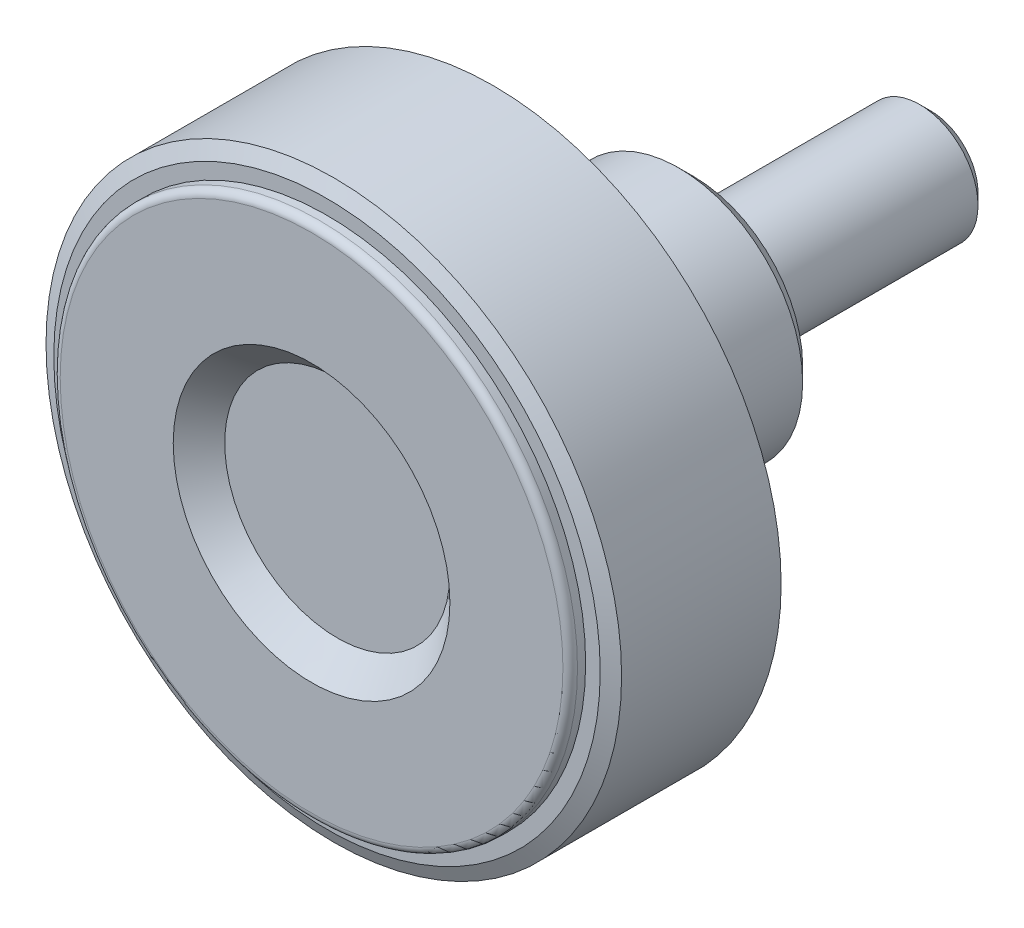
ISO-10303-21;
HEADER;
FILE_DESCRIPTION(('STEP AP214'),'2;1');
FILE_NAME('part.step','',(''),(''),'','','');
FILE_SCHEMA(('AUTOMOTIVE_DESIGN { 1 0 10303 214 1 1 1 1 }'));
ENDSEC;
DATA;
#1=APPLICATION_CONTEXT('core data for automotive mechanical design processes');
#2=APPLICATION_PROTOCOL_DEFINITION('international standard','automotive_design',2000,#1);
#3=PRODUCT_CONTEXT('',#1,'mechanical');
#4=PRODUCT('Part','Part','',(#3));
#5=PRODUCT_RELATED_PRODUCT_CATEGORY('part','',(#4));
#6=PRODUCT_DEFINITION_FORMATION('','',#4);
#7=PRODUCT_DEFINITION_CONTEXT('part definition',#1,'design');
#8=PRODUCT_DEFINITION('design','',#6,#7);
#9=PRODUCT_DEFINITION_SHAPE('','',#8);
#10=(LENGTH_UNIT() NAMED_UNIT(*) SI_UNIT(.MILLI.,.METRE.));
#11=(NAMED_UNIT(*) PLANE_ANGLE_UNIT() SI_UNIT($,.RADIAN.));
#12=(NAMED_UNIT(*) SI_UNIT($,.STERADIAN.) SOLID_ANGLE_UNIT());
#13=UNCERTAINTY_MEASURE_WITH_UNIT(LENGTH_MEASURE(1.E-05),#10,'distance_accuracy_value','');
#14=(GEOMETRIC_REPRESENTATION_CONTEXT(3) GLOBAL_UNCERTAINTY_ASSIGNED_CONTEXT((#13)) GLOBAL_UNIT_ASSIGNED_CONTEXT((#10,
#11,#12)) REPRESENTATION_CONTEXT('',''));
#15=CARTESIAN_POINT('',(0.,0.,0.));
#16=DIRECTION('',(0.,0.,1.));
#17=DIRECTION('',(1.,0.,0.));
#18=AXIS2_PLACEMENT_3D('',#15,#16,#17);
#19=CARTESIAN_POINT('',(0.,1.6165,-16.));
#20=DIRECTION('',(0.,0.,-1.));
#21=DIRECTION('',(-1.,0.,0.));
#22=AXIS2_PLACEMENT_3D('',#19,#20,#21);
#23=PLANE('',#22);
#24=CARTESIAN_POINT('',(0.,0.,-16.0000000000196));
#25=DIRECTION('',(0.,0.,1.));
#26=DIRECTION('',(1.,0.,0.));
#27=AXIS2_PLACEMENT_3D('',#24,#25,#26);
#28=CIRCLE('',#27,3.23299999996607);
#29=CARTESIAN_POINT('',(3.23299999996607,0.,-16.0000000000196));
#30=VERTEX_POINT('',#29);
#31=EDGE_CURVE('E179',#30,#30,#28,.T.);
#32=ORIENTED_EDGE('',*,*,#31,.F.);
#33=EDGE_LOOP('',(#32));
#34=FACE_BOUND('',#33,.T.);
#35=ADVANCED_FACE('F14',(#34),#23,.T.);
#36=CARTESIAN_POINT('',(0.,0.,-15.2329999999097));
#37=DIRECTION('',(0.,0.,1.));
#38=DIRECTION('',(1.,0.,0.));
#39=AXIS2_PLACEMENT_3D('',#36,#37,#38);
#40=CONICAL_SURFACE('',#39,4.00000000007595,0.785398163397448);
#41=ORIENTED_EDGE('',*,*,#31,.T.);
#42=EDGE_LOOP('',(#41));
#43=FACE_BOUND('',#42,.T.);
#44=CARTESIAN_POINT('',(0.,0.,-15.233));
#45=DIRECTION('',(0.,0.,1.));
#46=DIRECTION('',(1.,0.,0.));
#47=AXIS2_PLACEMENT_3D('',#44,#45,#46);
#48=CIRCLE('',#47,4.);
#49=CARTESIAN_POINT('',(4.,0.,-15.233));
#50=VERTEX_POINT('',#49);
#51=EDGE_CURVE('E176',#50,#50,#48,.T.);
#52=ORIENTED_EDGE('',*,*,#51,.F.);
#53=EDGE_LOOP('',(#52));
#54=FACE_BOUND('',#53,.T.);
#55=ADVANCED_FACE('F536',(#43,#54),#40,.T.);
#56=CARTESIAN_POINT('',(0.,0.,-7.1165));
#57=DIRECTION('',(0.,0.,1.));
#58=DIRECTION('',(1.,0.,0.));
#59=AXIS2_PLACEMENT_3D('',#56,#57,#58);
#60=CYLINDRICAL_SURFACE('',#59,4.);
#61=ORIENTED_EDGE('',*,*,#51,.T.);
#62=EDGE_LOOP('',(#61));
#63=FACE_BOUND('',#62,.T.);
#64=CARTESIAN_POINT('',(0.,0.,0.));
#65=DIRECTION('',(0.,0.,1.));
#66=DIRECTION('',(1.,0.,0.));
#67=AXIS2_PLACEMENT_3D('',#64,#65,#66);
#68=CIRCLE('',#67,4.);
#69=CARTESIAN_POINT('',(4.,0.,0.));
#70=VERTEX_POINT('',#69);
#71=EDGE_CURVE('E178',#70,#70,#68,.T.);
#72=ORIENTED_EDGE('',*,*,#71,.F.);
#73=EDGE_LOOP('',(#72));
#74=FACE_BOUND('',#73,.T.);
#75=ADVANCED_FACE('F526',(#63,#74),#60,.T.);
#76=CARTESIAN_POINT('',(0.,2.66666666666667,0.));
#77=DIRECTION('',(0.,0.,-1.));
#78=DIRECTION('',(-1.,0.,0.));
#79=AXIS2_PLACEMENT_3D('',#76,#77,#78);
#80=PLANE('',#79);
#81=CARTESIAN_POINT('',(0.,0.,0.));
#82=DIRECTION('',(0.,0.,1.));
#83=DIRECTION('',(1.,0.,0.));
#84=AXIS2_PLACEMENT_3D('',#81,#82,#83);
#85=CIRCLE('',#84,5.33333333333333);
#86=CARTESIAN_POINT('',(5.33333333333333,0.,0.));
#87=VERTEX_POINT('',#86);
#88=EDGE_CURVE('E211',#87,#87,#85,.T.);
#89=ORIENTED_EDGE('',*,*,#88,.F.);
#90=EDGE_LOOP('',(#89));
#91=FACE_BOUND('',#90,.T.);
#92=ORIENTED_EDGE('',*,*,#71,.T.);
#93=EDGE_LOOP('',(#92));
#94=FACE_BOUND('',#93,.T.);
#95=ADVANCED_FACE('F516',(#91,#94),#80,.T.);
#96=CARTESIAN_POINT('',(0.,0.,0.15));
#97=DIRECTION('',(0.,0.,1.));
#98=DIRECTION('',(1.,0.,0.));
#99=AXIS2_PLACEMENT_3D('',#96,#97,#98);
#100=CYLINDRICAL_SURFACE('',#99,5.33333333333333);
#101=ORIENTED_EDGE('',*,*,#88,.T.);
#102=EDGE_LOOP('',(#101));
#103=FACE_BOUND('',#102,.T.);
#104=CARTESIAN_POINT('',(0.,0.,0.3));
#105=DIRECTION('',(0.,0.,1.));
#106=DIRECTION('',(1.,0.,0.));
#107=AXIS2_PLACEMENT_3D('',#104,#105,#106);
#108=CIRCLE('',#107,5.33333333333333);
#109=CARTESIAN_POINT('',(5.33333333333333,0.,0.3));
#110=VERTEX_POINT('',#109);
#111=EDGE_CURVE('E208',#110,#110,#108,.T.);
#112=ORIENTED_EDGE('',*,*,#111,.F.);
#113=EDGE_LOOP('',(#112));
#114=FACE_BOUND('',#113,.T.);
#115=ADVANCED_FACE('F506',(#103,#114),#100,.T.);
#116=CARTESIAN_POINT('',(0.,6.41666666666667,0.3));
#117=DIRECTION('',(0.,0.,-1.));
#118=DIRECTION('',(-1.,0.,0.));
#119=AXIS2_PLACEMENT_3D('',#116,#117,#118);
#120=PLANE('',#119);
#121=CARTESIAN_POINT('',(0.,0.,0.3));
#122=DIRECTION('',(0.,0.,1.));
#123=DIRECTION('',(1.,0.,0.));
#124=AXIS2_PLACEMENT_3D('',#121,#122,#123);
#125=CIRCLE('',#124,7.5);
#126=CARTESIAN_POINT('',(7.5,0.,0.3));
#127=VERTEX_POINT('',#126);
#128=EDGE_CURVE('E175',#127,#127,#125,.T.);
#129=ORIENTED_EDGE('',*,*,#128,.F.);
#130=EDGE_LOOP('',(#129));
#131=FACE_BOUND('',#130,.T.);
#132=ORIENTED_EDGE('',*,*,#111,.T.);
#133=EDGE_LOOP('',(#132));
#134=FACE_BOUND('',#133,.T.);
#135=ADVANCED_FACE('F496',(#131,#134),#120,.T.);
#136=CARTESIAN_POINT('',(0.,0.,1.3));
#137=DIRECTION('',(0.,0.,1.));
#138=DIRECTION('',(1.,0.,0.));
#139=AXIS2_PLACEMENT_3D('',#136,#137,#138);
#140=CONICAL_SURFACE('',#139,8.5,0.785398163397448);
#141=ORIENTED_EDGE('',*,*,#128,.T.);
#142=EDGE_LOOP('',(#141));
#143=FACE_BOUND('',#142,.T.);
#144=CARTESIAN_POINT('',(0.,0.,1.3));
#145=DIRECTION('',(0.,0.,1.));
#146=DIRECTION('',(1.,0.,0.));
#147=AXIS2_PLACEMENT_3D('',#144,#145,#146);
#148=CIRCLE('',#147,8.5);
#149=CARTESIAN_POINT('',(8.5,0.,1.3));
#150=VERTEX_POINT('',#149);
#151=EDGE_CURVE('E172',#150,#150,#148,.T.);
#152=ORIENTED_EDGE('',*,*,#151,.F.);
#153=EDGE_LOOP('',(#152));
#154=FACE_BOUND('',#153,.T.);
#155=ADVANCED_FACE('F487',(#143,#154),#140,.T.);
#156=CARTESIAN_POINT('',(0.,0.,11.1916666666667));
#157=DIRECTION('',(0.,0.,1.));
#158=DIRECTION('',(1.,0.,0.));
#159=AXIS2_PLACEMENT_3D('',#156,#157,#158);
#160=CYLINDRICAL_SURFACE('',#159,8.5);
#161=ORIENTED_EDGE('',*,*,#151,.T.);
#162=EDGE_LOOP('',(#161));
#163=FACE_BOUND('',#162,.T.);
#164=CARTESIAN_POINT('',(0.,0.,21.0833333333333));
#165=DIRECTION('',(0.,0.,-1.));
#166=DIRECTION('',(-1.,0.,0.));
#167=AXIS2_PLACEMENT_3D('',#164,#165,#166);
#168=CIRCLE('',#167,8.5);
#169=CARTESIAN_POINT('',(-8.5,0.,21.0833333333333));
#170=VERTEX_POINT('',#169);
#171=EDGE_CURVE('E75',#170,#170,#168,.T.);
#172=ORIENTED_EDGE('',*,*,#171,.T.);
#173=EDGE_LOOP('',(#172));
#174=FACE_BOUND('',#173,.T.);
#175=ADVANCED_FACE('F482',(#163,#174),#160,.T.);
#176=CARTESIAN_POINT('',(0.,0.,21.0833333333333));
#177=DIRECTION('',(0.,0.,-1.));
#178=DIRECTION('',(-1.,0.,0.));
#179=AXIS2_PLACEMENT_3D('',#176,#177,#178);
#180=TOROIDAL_SURFACE('',#179,9.5,1.);
#181=CARTESIAN_POINT('',(0.,0.,22.0833333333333));
#182=DIRECTION('',(0.,0.,-1.));
#183=DIRECTION('',(1.,0.,0.));
#184=AXIS2_PLACEMENT_3D('',#181,#182,#183);
#185=CIRCLE('',#184,9.5);
#186=CARTESIAN_POINT('',(-9.5,0.,22.0833333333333));
#187=VERTEX_POINT('',#186);
#188=CARTESIAN_POINT('',(9.5,0.,22.0833333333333));
#189=VERTEX_POINT('',#188);
#190=EDGE_CURVE('E68',#187,#189,#185,.F.);
#191=ORIENTED_EDGE('',*,*,#190,.F.);
#192=CARTESIAN_POINT('',(0.,0.,22.0833333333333));
#193=DIRECTION('',(0.,0.,-1.));
#194=DIRECTION('',(-1.,0.,0.));
#195=AXIS2_PLACEMENT_3D('',#192,#193,#194);
#196=CIRCLE('',#195,9.5);
#197=CARTESIAN_POINT('',(0.,9.5,22.0833333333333));
#198=VERTEX_POINT('',#197);
#199=EDGE_CURVE('E71',#198,#187,#196,.F.);
#200=ORIENTED_EDGE('',*,*,#199,.F.);
#201=CARTESIAN_POINT('',(0.,0.,22.0833333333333));
#202=DIRECTION('',(0.,0.,-1.));
#203=DIRECTION('',(0.,1.,0.));
#204=AXIS2_PLACEMENT_3D('',#201,#202,#203);
#205=CIRCLE('',#204,9.5);
#206=EDGE_CURVE('E63',#189,#198,#205,.F.);
#207=ORIENTED_EDGE('',*,*,#206,.F.);
#208=EDGE_LOOP('',(#191,#200,#207));
#209=FACE_BOUND('',#208,.T.);
#210=ORIENTED_EDGE('',*,*,#171,.F.);
#211=EDGE_LOOP('',(#210));
#212=FACE_BOUND('',#211,.T.);
#213=ADVANCED_FACE('F66',(#209,#212),#180,.F.);
#214=CARTESIAN_POINT('',(0.,11.8461538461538,22.0833333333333));
#215=DIRECTION('',(0.,0.,-1.));
#216=DIRECTION('',(-1.,0.,0.));
#217=AXIS2_PLACEMENT_3D('',#214,#215,#216);
#218=PLANE('',#217);
#219=CARTESIAN_POINT('',(0.,0.,22.0833333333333));
#220=DIRECTION('',(0.,0.,1.));
#221=DIRECTION('',(-1.,0.,0.));
#222=AXIS2_PLACEMENT_3D('',#219,#220,#221);
#223=CIRCLE('',#222,14.1923076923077);
#224=CARTESIAN_POINT('',(14.1923076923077,0.,22.0833333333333));
#225=VERTEX_POINT('',#224);
#226=CARTESIAN_POINT('',(-14.1923076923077,0.,22.0833333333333));
#227=VERTEX_POINT('',#226);
#228=EDGE_CURVE('E81',#225,#227,#223,.F.);
#229=ORIENTED_EDGE('',*,*,#228,.T.);
#230=CARTESIAN_POINT('',(0.,0.,22.0833333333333));
#231=DIRECTION('',(0.,0.,1.));
#232=DIRECTION('',(0.,1.,0.));
#233=AXIS2_PLACEMENT_3D('',#230,#231,#232);
#234=CIRCLE('',#233,14.1923076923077);
#235=CARTESIAN_POINT('',(0.,14.1923076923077,22.0833333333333));
#236=VERTEX_POINT('',#235);
#237=EDGE_CURVE('E130',#227,#236,#234,.F.);
#238=ORIENTED_EDGE('',*,*,#237,.T.);
#239=CARTESIAN_POINT('',(0.,0.,22.0833333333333));
#240=DIRECTION('',(0.,0.,1.));
#241=DIRECTION('',(1.,0.,0.));
#242=AXIS2_PLACEMENT_3D('',#239,#240,#241);
#243=CIRCLE('',#242,14.1923076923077);
#244=EDGE_CURVE('E143',#236,#225,#243,.F.);
#245=ORIENTED_EDGE('',*,*,#244,.T.);
#246=EDGE_LOOP('',(#229,#238,#245));
#247=FACE_BOUND('',#246,.T.);
#248=ORIENTED_EDGE('',*,*,#199,.T.);
#249=ORIENTED_EDGE('',*,*,#190,.T.);
#250=ORIENTED_EDGE('',*,*,#206,.T.);
#251=EDGE_LOOP('',(#248,#249,#250));
#252=FACE_BOUND('',#251,.T.);
#253=ADVANCED_FACE('F79',(#247,#252),#218,.T.);
#254=CARTESIAN_POINT('',(0.,0.,21.0833333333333));
#255=DIRECTION('',(0.,0.,-1.));
#256=DIRECTION('',(-1.,0.,0.));
#257=AXIS2_PLACEMENT_3D('',#254,#255,#256);
#258=TOROIDAL_SURFACE('',#257,14.1923076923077,1.);
#259=ORIENTED_EDGE('',*,*,#237,.F.);
#260=ORIENTED_EDGE('',*,*,#228,.F.);
#261=ORIENTED_EDGE('',*,*,#244,.F.);
#262=EDGE_LOOP('',(#259,#260,#261));
#263=FACE_BOUND('',#262,.T.);
#264=CARTESIAN_POINT('',(0.,0.,21.0833333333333));
#265=DIRECTION('',(0.,0.,1.));
#266=DIRECTION('',(1.,0.,0.));
#267=AXIS2_PLACEMENT_3D('',#264,#265,#266);
#268=CIRCLE('',#267,15.1923076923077);
#269=CARTESIAN_POINT('',(15.1923076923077,0.,21.0833333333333));
#270=VERTEX_POINT('',#269);
#271=EDGE_CURVE('E205',#270,#270,#268,.F.);
#272=ORIENTED_EDGE('',*,*,#271,.T.);
#273=EDGE_LOOP('',(#272));
#274=FACE_BOUND('',#273,.T.);
#275=ADVANCED_FACE('F100',(#263,#274),#258,.F.);
#276=CARTESIAN_POINT('',(0.,0.,16.7916666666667));
#277=DIRECTION('',(0.,0.,1.));
#278=DIRECTION('',(1.,0.,0.));
#279=AXIS2_PLACEMENT_3D('',#276,#277,#278);
#280=CYLINDRICAL_SURFACE('',#279,15.1923076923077);
#281=ORIENTED_EDGE('',*,*,#271,.F.);
#282=EDGE_LOOP('',(#281));
#283=FACE_BOUND('',#282,.T.);
#284=CARTESIAN_POINT('',(0.,0.,12.5));
#285=DIRECTION('',(0.,0.,1.));
#286=DIRECTION('',(1.,0.,0.));
#287=AXIS2_PLACEMENT_3D('',#284,#285,#286);
#288=CIRCLE('',#287,15.1923076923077);
#289=CARTESIAN_POINT('',(15.1923076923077,0.,12.5));
#290=VERTEX_POINT('',#289);
#291=EDGE_CURVE('E201',#290,#290,#288,.T.);
#292=ORIENTED_EDGE('',*,*,#291,.F.);
#293=EDGE_LOOP('',(#292));
#294=FACE_BOUND('',#293,.T.);
#295=ADVANCED_FACE('F329',(#283,#294),#280,.F.);
#296=CARTESIAN_POINT('',(0.,16.2211538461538,12.5));
#297=DIRECTION('',(0.,0.,-1.));
#298=DIRECTION('',(-1.,0.,0.));
#299=AXIS2_PLACEMENT_3D('',#296,#297,#298);
#300=PLANE('',#299);
#301=CARTESIAN_POINT('',(0.,0.,12.5));
#302=DIRECTION('',(0.,0.,1.));
#303=DIRECTION('',(-1.,0.,0.));
#304=AXIS2_PLACEMENT_3D('',#301,#302,#303);
#305=CIRCLE('',#304,17.25);
#306=CARTESIAN_POINT('',(-17.25,0.,12.5));
#307=VERTEX_POINT('',#306);
#308=CARTESIAN_POINT('',(17.25,0.,12.5));
#309=VERTEX_POINT('',#308);
#310=EDGE_CURVE('E264',#307,#309,#305,.T.);
#311=ORIENTED_EDGE('',*,*,#310,.F.);
#312=CARTESIAN_POINT('',(0.,0.,12.5));
#313=DIRECTION('',(0.,0.,1.));
#314=DIRECTION('',(0.,1.,0.));
#315=AXIS2_PLACEMENT_3D('',#312,#313,#314);
#316=CIRCLE('',#315,17.25);
#317=CARTESIAN_POINT('',(0.,17.25,12.5));
#318=VERTEX_POINT('',#317);
#319=EDGE_CURVE('E299',#318,#307,#316,.T.);
#320=ORIENTED_EDGE('',*,*,#319,.F.);
#321=CARTESIAN_POINT('',(0.,0.,12.5));
#322=DIRECTION('',(0.,0.,1.));
#323=DIRECTION('',(1.,0.,0.));
#324=AXIS2_PLACEMENT_3D('',#321,#322,#323);
#325=CIRCLE('',#324,17.25);
#326=EDGE_CURVE('E204',#309,#318,#325,.T.);
#327=ORIENTED_EDGE('',*,*,#326,.F.);
#328=EDGE_LOOP('',(#311,#320,#327));
#329=FACE_BOUND('',#328,.T.);
#330=ORIENTED_EDGE('',*,*,#291,.T.);
#331=EDGE_LOOP('',(#330));
#332=FACE_BOUND('',#331,.T.);
#333=ADVANCED_FACE('F275',(#329,#332),#300,.T.);
#334=CARTESIAN_POINT('',(0.,0.,13.));
#335=DIRECTION('',(0.,0.,-1.));
#336=DIRECTION('',(-1.,0.,0.));
#337=AXIS2_PLACEMENT_3D('',#334,#335,#336);
#338=TOROIDAL_SURFACE('',#337,17.25,0.5);
#339=ORIENTED_EDGE('',*,*,#319,.T.);
#340=ORIENTED_EDGE('',*,*,#310,.T.);
#341=ORIENTED_EDGE('',*,*,#326,.T.);
#342=EDGE_LOOP('',(#339,#340,#341));
#343=FACE_BOUND('',#342,.T.);
#344=CARTESIAN_POINT('',(0.,0.,13.));
#345=DIRECTION('',(0.,0.,1.));
#346=DIRECTION('',(1.,0.,0.));
#347=AXIS2_PLACEMENT_3D('',#344,#345,#346);
#348=CIRCLE('',#347,17.75);
#349=CARTESIAN_POINT('',(17.75,0.,13.));
#350=VERTEX_POINT('',#349);
#351=EDGE_CURVE('E200',#350,#350,#348,.T.);
#352=ORIENTED_EDGE('',*,*,#351,.F.);
#353=EDGE_LOOP('',(#352));
#354=FACE_BOUND('',#353,.T.);
#355=ADVANCED_FACE('F269',(#343,#354),#338,.T.);
#356=CARTESIAN_POINT('',(0.,0.,13.28));
#357=DIRECTION('',(0.,0.,1.));
#358=DIRECTION('',(1.,0.,0.));
#359=AXIS2_PLACEMENT_3D('',#356,#357,#358);
#360=CYLINDRICAL_SURFACE('',#359,17.75);
#361=ORIENTED_EDGE('',*,*,#351,.T.);
#362=EDGE_LOOP('',(#361));
#363=FACE_BOUND('',#362,.T.);
#364=CARTESIAN_POINT('',(0.,0.,13.56));
#365=DIRECTION('',(0.,0.,1.));
#366=DIRECTION('',(1.,0.,0.));
#367=AXIS2_PLACEMENT_3D('',#364,#365,#366);
#368=CIRCLE('',#367,17.75);
#369=CARTESIAN_POINT('',(17.75,0.,13.56));
#370=VERTEX_POINT('',#369);
#371=EDGE_CURVE('E197',#370,#370,#368,.T.);
#372=ORIENTED_EDGE('',*,*,#371,.F.);
#373=EDGE_LOOP('',(#372));
#374=FACE_BOUND('',#373,.T.);
#375=ADVANCED_FACE('F274',(#363,#374),#360,.T.);
#376=CARTESIAN_POINT('',(0.,18.25,13.56));
#377=DIRECTION('',(0.,0.,-1.));
#378=DIRECTION('',(-1.,0.,0.));
#379=AXIS2_PLACEMENT_3D('',#376,#377,#378);
#380=PLANE('',#379);
#381=CARTESIAN_POINT('',(0.,0.,13.56));
#382=DIRECTION('',(0.,0.,1.));
#383=DIRECTION('',(1.,0.,0.));
#384=AXIS2_PLACEMENT_3D('',#381,#382,#383);
#385=CIRCLE('',#384,18.75);
#386=CARTESIAN_POINT('',(18.75,0.,13.56));
#387=VERTEX_POINT('',#386);
#388=EDGE_CURVE('E193',#387,#387,#385,.T.);
#389=ORIENTED_EDGE('',*,*,#388,.F.);
#390=EDGE_LOOP('',(#389));
#391=FACE_BOUND('',#390,.T.);
#392=ORIENTED_EDGE('',*,*,#371,.T.);
#393=EDGE_LOOP('',(#392));
#394=FACE_BOUND('',#393,.T.);
#395=ADVANCED_FACE('F342',(#391,#394),#380,.T.);
#396=CARTESIAN_POINT('',(0.,0.,14.026307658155));
#397=DIRECTION('',(0.,0.,1.));
#398=DIRECTION('',(1.,0.,0.));
#399=AXIS2_PLACEMENT_3D('',#396,#397,#398);
#400=CONICAL_SURFACE('',#399,19.75,1.13446401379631);
#401=CARTESIAN_POINT('',(-1.50102152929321E-13,-1.52766688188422E-12,14.026307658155));
#402=DIRECTION('',(0.,0.,-1.));
#403=DIRECTION('',(-1.,0.,0.));
#404=AXIS2_PLACEMENT_3D('',#401,#402,#403);
#405=CIRCLE('',#404,19.7500000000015);
#406=CARTESIAN_POINT('',(-19.7500000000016,-1.52766688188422E-12,14.026307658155));
#407=VERTEX_POINT('',#406);
#408=EDGE_CURVE('E196',#407,#407,#405,.F.);
#409=ORIENTED_EDGE('',*,*,#408,.F.);
#410=EDGE_LOOP('',(#409));
#411=FACE_BOUND('',#410,.T.);
#412=ORIENTED_EDGE('',*,*,#388,.T.);
#413=EDGE_LOOP('',(#412));
#414=FACE_BOUND('',#413,.T.);
#415=ADVANCED_FACE('F340',(#411,#414),#400,.T.);
#416=CARTESIAN_POINT('',(0.,3.86363636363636,24.7333333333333));
#417=DIRECTION('',(0.,0.,1.));
#418=DIRECTION('',(1.,0.,0.));
#419=AXIS2_PLACEMENT_3D('',#416,#417,#418);
#420=PLANE('',#419);
#421=CARTESIAN_POINT('',(0.,0.,24.7333333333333));
#422=DIRECTION('',(0.,0.,1.));
#423=DIRECTION('',(1.,0.,0.));
#424=AXIS2_PLACEMENT_3D('',#421,#422,#423);
#425=CIRCLE('',#424,7.7272727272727);
#426=CARTESIAN_POINT('',(7.7272727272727,0.,24.7333333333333));
#427=VERTEX_POINT('',#426);
#428=EDGE_CURVE('E181',#427,#427,#425,.T.);
#429=ORIENTED_EDGE('',*,*,#428,.T.);
#430=EDGE_LOOP('',(#429));
#431=FACE_BOUND('',#430,.T.);
#432=ADVANCED_FACE('F242',(#431),#420,.T.);
#433=CARTESIAN_POINT('',(0.,0.,26.5));
#434=DIRECTION('',(0.,0.,1.));
#435=DIRECTION('',(1.,0.,0.));
#436=AXIS2_PLACEMENT_3D('',#433,#434,#435);
#437=CONICAL_SURFACE('',#436,9.49393939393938,0.785398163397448);
#438=CARTESIAN_POINT('',(0.,0.,26.5));
#439=DIRECTION('',(0.,0.,1.));
#440=DIRECTION('',(1.,0.,0.));
#441=AXIS2_PLACEMENT_3D('',#438,#439,#440);
#442=CIRCLE('',#441,9.49393939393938);
#443=CARTESIAN_POINT('',(9.49393939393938,0.,26.5));
#444=VERTEX_POINT('',#443);
#445=EDGE_CURVE('E9',#444,#444,#442,.F.);
#446=ORIENTED_EDGE('',*,*,#445,.F.);
#447=EDGE_LOOP('',(#446));
#448=FACE_BOUND('',#447,.T.);
#449=ORIENTED_EDGE('',*,*,#428,.F.);
#450=EDGE_LOOP('',(#449));
#451=FACE_BOUND('',#450,.T.);
#452=ADVANCED_FACE('F240',(#448,#451),#437,.F.);
#453=CARTESIAN_POINT('',(0.,13.3719696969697,26.5));
#454=DIRECTION('',(0.,0.,1.));
#455=DIRECTION('',(1.,0.,0.));
#456=AXIS2_PLACEMENT_3D('',#453,#454,#455);
#457=PLANE('',#456);
#458=ORIENTED_EDGE('',*,*,#445,.T.);
#459=EDGE_LOOP('',(#458));
#460=FACE_BOUND('',#459,.T.);
#461=CARTESIAN_POINT('',(0.,0.,26.5));
#462=DIRECTION('',(0.,0.,-1.));
#463=DIRECTION('',(-1.,0.,0.));
#464=AXIS2_PLACEMENT_3D('',#461,#462,#463);
#465=CIRCLE('',#464,17.25);
#466=CARTESIAN_POINT('',(0.,17.25,26.5));
#467=VERTEX_POINT('',#466);
#468=CARTESIAN_POINT('',(-17.25,0.,26.5));
#469=VERTEX_POINT('',#468);
#470=EDGE_CURVE('E219',#467,#469,#465,.F.);
#471=ORIENTED_EDGE('',*,*,#470,.T.);
#472=CARTESIAN_POINT('',(0.,0.,26.5));
#473=DIRECTION('',(0.,0.,-1.));
#474=DIRECTION('',(1.,0.,0.));
#475=AXIS2_PLACEMENT_3D('',#472,#473,#474);
#476=CIRCLE('',#475,17.25);
#477=CARTESIAN_POINT('',(17.25,0.,26.5));
#478=VERTEX_POINT('',#477);
#479=EDGE_CURVE('E23',#469,#478,#476,.F.);
#480=ORIENTED_EDGE('',*,*,#479,.T.);
#481=CARTESIAN_POINT('',(0.,0.,26.5));
#482=DIRECTION('',(0.,0.,-1.));
#483=DIRECTION('',(0.,1.,0.));
#484=AXIS2_PLACEMENT_3D('',#481,#482,#483);
#485=CIRCLE('',#484,17.25);
#486=EDGE_CURVE('E184',#478,#467,#485,.F.);
#487=ORIENTED_EDGE('',*,*,#486,.T.);
#488=EDGE_LOOP('',(#471,#480,#487));
#489=FACE_BOUND('',#488,.T.);
#490=ADVANCED_FACE('F238',(#460,#489),#457,.T.);
#491=CARTESIAN_POINT('',(0.,0.,26.));
#492=DIRECTION('',(0.,0.,-1.));
#493=DIRECTION('',(-1.,0.,0.));
#494=AXIS2_PLACEMENT_3D('',#491,#492,#493);
#495=TOROIDAL_SURFACE('',#494,17.25,0.5);
#496=CARTESIAN_POINT('',(0.,0.,26.));
#497=DIRECTION('',(0.,0.,-1.));
#498=DIRECTION('',(-1.,0.,0.));
#499=AXIS2_PLACEMENT_3D('',#496,#497,#498);
#500=CIRCLE('',#499,17.75);
#501=CARTESIAN_POINT('',(-17.75,0.,26.));
#502=VERTEX_POINT('',#501);
#503=EDGE_CURVE('E185',#502,#502,#500,.F.);
#504=ORIENTED_EDGE('',*,*,#503,.T.);
#505=EDGE_LOOP('',(#504));
#506=FACE_BOUND('',#505,.T.);
#507=ORIENTED_EDGE('',*,*,#479,.F.);
#508=ORIENTED_EDGE('',*,*,#470,.F.);
#509=ORIENTED_EDGE('',*,*,#486,.F.);
#510=EDGE_LOOP('',(#507,#508,#509));
#511=FACE_BOUND('',#510,.T.);
#512=ADVANCED_FACE('F226',(#506,#511),#495,.T.);
#513=CARTESIAN_POINT('',(0.,0.,25.72));
#514=DIRECTION('',(0.,0.,1.));
#515=DIRECTION('',(1.,0.,0.));
#516=AXIS2_PLACEMENT_3D('',#513,#514,#515);
#517=CYLINDRICAL_SURFACE('',#516,17.75);
#518=ORIENTED_EDGE('',*,*,#503,.F.);
#519=EDGE_LOOP('',(#518));
#520=FACE_BOUND('',#519,.T.);
#521=CARTESIAN_POINT('',(0.,0.,25.44));
#522=DIRECTION('',(0.,0.,1.));
#523=DIRECTION('',(1.,0.,0.));
#524=AXIS2_PLACEMENT_3D('',#521,#522,#523);
#525=CIRCLE('',#524,17.75);
#526=CARTESIAN_POINT('',(17.75,0.,25.44));
#527=VERTEX_POINT('',#526);
#528=EDGE_CURVE('E186',#527,#527,#525,.T.);
#529=ORIENTED_EDGE('',*,*,#528,.T.);
#530=EDGE_LOOP('',(#529));
#531=FACE_BOUND('',#530,.T.);
#532=ADVANCED_FACE('F237',(#520,#531),#517,.T.);
#533=CARTESIAN_POINT('',(0.,0.,24.973692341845));
#534=DIRECTION('',(0.,0.,-1.));
#535=DIRECTION('',(-1.,0.,0.));
#536=AXIS2_PLACEMENT_3D('',#533,#534,#535);
#537=CONICAL_SURFACE('',#536,19.75,1.13446401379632);
#538=CARTESIAN_POINT('',(0.,0.,25.44));
#539=DIRECTION('',(0.,0.,-1.));
#540=DIRECTION('',(-1.,0.,0.));
#541=AXIS2_PLACEMENT_3D('',#538,#539,#540);
#542=CIRCLE('',#541,18.75);
#543=CARTESIAN_POINT('',(-18.75,0.,25.44));
#544=VERTEX_POINT('',#543);
#545=EDGE_CURVE('E189',#544,#544,#542,.F.);
#546=ORIENTED_EDGE('',*,*,#545,.F.);
#547=EDGE_LOOP('',(#546));
#548=FACE_BOUND('',#547,.T.);
#549=CARTESIAN_POINT('',(0.,0.,24.973692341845));
#550=DIRECTION('',(0.,0.,-1.));
#551=DIRECTION('',(0.,1.,0.));
#552=AXIS2_PLACEMENT_3D('',#549,#550,#551);
#553=CIRCLE('',#552,19.75);
#554=CARTESIAN_POINT('',(0.,19.75,24.973692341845));
#555=VERTEX_POINT('',#554);
#556=EDGE_CURVE('E192',#555,#555,#553,.F.);
#557=ORIENTED_EDGE('',*,*,#556,.T.);
#558=EDGE_LOOP('',(#557));
#559=FACE_BOUND('',#558,.T.);
#560=ADVANCED_FACE('F360',(#548,#559),#537,.T.);
#561=CARTESIAN_POINT('',(0.,18.25,25.44));
#562=DIRECTION('',(0.,0.,1.));
#563=DIRECTION('',(1.,0.,0.));
#564=AXIS2_PLACEMENT_3D('',#561,#562,#563);
#565=PLANE('',#564);
#566=ORIENTED_EDGE('',*,*,#528,.F.);
#567=EDGE_LOOP('',(#566));
#568=FACE_BOUND('',#567,.T.);
#569=ORIENTED_EDGE('',*,*,#545,.T.);
#570=EDGE_LOOP('',(#569));
#571=FACE_BOUND('',#570,.T.);
#572=ADVANCED_FACE('F358',(#568,#571),#565,.T.);
#573=CARTESIAN_POINT('',(-1.50102152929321E-13,-1.52766688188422E-12,0.));
#574=DIRECTION('',(0.,0.,-1.));
#575=DIRECTION('',(-1.,0.,0.));
#576=AXIS2_PLACEMENT_3D('',#573,#574,#575);
#577=CYLINDRICAL_SURFACE('',#576,19.7500000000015);
#578=ORIENTED_EDGE('',*,*,#408,.T.);
#579=EDGE_LOOP('',(#578));
#580=FACE_BOUND('',#579,.T.);
#581=ORIENTED_EDGE('',*,*,#556,.F.);
#582=EDGE_LOOP('',(#581));
#583=FACE_BOUND('',#582,.T.);
#584=ADVANCED_FACE('F355',(#580,#583),#577,.T.);
#585=CLOSED_SHELL('',(#35,#55,#75,#95,#115,#135,#155,#175,#213,#253,#275,#295,#333,#355,#375,
#395,#415,#432,#452,#490,#512,#532,#560,#572,#584));
#586=MANIFOLD_SOLID_BREP('B1',#585);
#587=ADVANCED_BREP_SHAPE_REPRESENTATION('',(#18,#586),#14);
#588=SHAPE_DEFINITION_REPRESENTATION(#9,#587);
ENDSEC;
END-ISO-10303-21;
